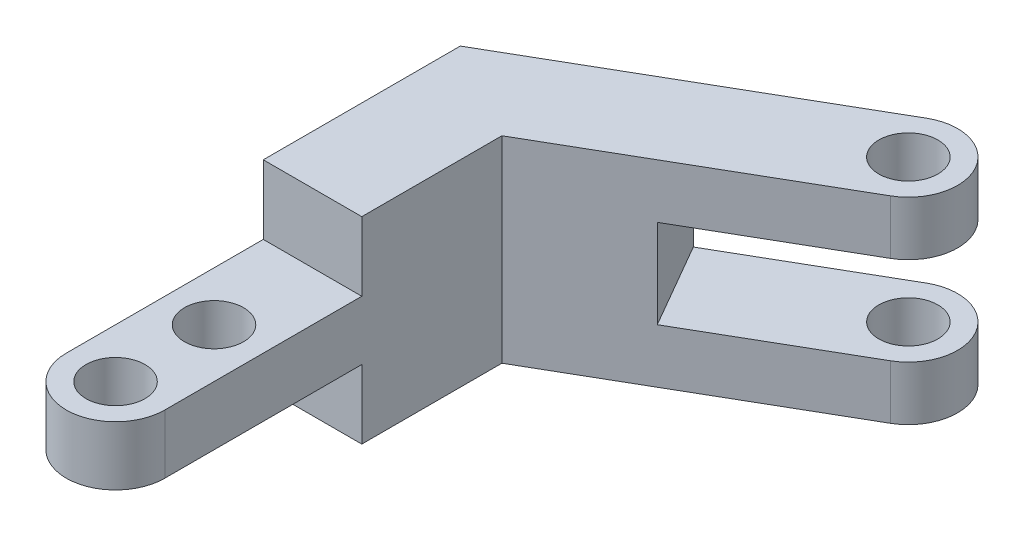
ISO-10303-21;
HEADER;
FILE_DESCRIPTION(('STEP AP214'),'2;1');
FILE_NAME('part.step','',(''),(''),'','','');
FILE_SCHEMA(('AUTOMOTIVE_DESIGN { 1 0 10303 214 1 1 1 1 }'));
ENDSEC;
DATA;
#1=APPLICATION_CONTEXT('core data for automotive mechanical design processes');
#2=APPLICATION_PROTOCOL_DEFINITION('international standard','automotive_design',2000,#1);
#3=PRODUCT_CONTEXT('',#1,'mechanical');
#4=PRODUCT('Part','Part','',(#3));
#5=PRODUCT_RELATED_PRODUCT_CATEGORY('part','',(#4));
#6=PRODUCT_DEFINITION_FORMATION('','',#4);
#7=PRODUCT_DEFINITION_CONTEXT('part definition',#1,'design');
#8=PRODUCT_DEFINITION('design','',#6,#7);
#9=PRODUCT_DEFINITION_SHAPE('','',#8);
#10=(LENGTH_UNIT() NAMED_UNIT(*) SI_UNIT(.MILLI.,.METRE.));
#11=(NAMED_UNIT(*) PLANE_ANGLE_UNIT() SI_UNIT($,.RADIAN.));
#12=(NAMED_UNIT(*) SI_UNIT($,.STERADIAN.) SOLID_ANGLE_UNIT());
#13=UNCERTAINTY_MEASURE_WITH_UNIT(LENGTH_MEASURE(1.E-05),#10,'distance_accuracy_value','');
#14=(GEOMETRIC_REPRESENTATION_CONTEXT(3) GLOBAL_UNCERTAINTY_ASSIGNED_CONTEXT((#13)) GLOBAL_UNIT_ASSIGNED_CONTEXT((#10,
#11,#12)) REPRESENTATION_CONTEXT('',''));
#15=CARTESIAN_POINT('',(0.,0.,0.));
#16=DIRECTION('',(0.,0.,1.));
#17=DIRECTION('',(1.,0.,0.));
#18=AXIS2_PLACEMENT_3D('',#15,#16,#17);
#19=CARTESIAN_POINT('',(2.5,10.,20.));
#20=DIRECTION('',(0.,-1.,0.));
#21=DIRECTION('',(0.,0.,-1.));
#22=AXIS2_PLACEMENT_3D('',#19,#20,#21);
#23=CYLINDRICAL_SURFACE('',#22,2.5);
#24=DIRECTION('',(0.,-1.,0.));
#25=VECTOR('',#24,1.);
#26=CARTESIAN_POINT('',(0.,10.,20.));
#27=LINE('',#26,#25);
#28=CARTESIAN_POINT('',(0.,6.5,20.));
#29=VERTEX_POINT('',#28);
#30=CARTESIAN_POINT('',(0.,3.5,20.));
#31=VERTEX_POINT('',#30);
#32=EDGE_CURVE('E55',#29,#31,#27,.T.);
#33=ORIENTED_EDGE('',*,*,#32,.T.);
#34=CARTESIAN_POINT('',(2.5,3.5,20.));
#35=DIRECTION('',(0.,1.,0.));
#36=DIRECTION('',(0.,0.,1.));
#37=AXIS2_PLACEMENT_3D('',#34,#35,#36);
#38=CIRCLE('',#37,2.5);
#39=CARTESIAN_POINT('',(5.,3.5,20.));
#40=VERTEX_POINT('',#39);
#41=EDGE_CURVE('E154',#31,#40,#38,.T.);
#42=ORIENTED_EDGE('',*,*,#41,.T.);
#43=DIRECTION('',(0.,-1.,0.));
#44=VECTOR('',#43,1.);
#45=CARTESIAN_POINT('',(5.,10.,20.));
#46=LINE('',#45,#44);
#47=CARTESIAN_POINT('',(5.,6.5,20.));
#48=VERTEX_POINT('',#47);
#49=EDGE_CURVE('E314',#48,#40,#46,.T.);
#50=ORIENTED_EDGE('',*,*,#49,.F.);
#51=CARTESIAN_POINT('',(2.5,6.5,20.));
#52=DIRECTION('',(0.,1.,0.));
#53=DIRECTION('',(0.,0.,1.));
#54=AXIS2_PLACEMENT_3D('',#51,#52,#53);
#55=CIRCLE('',#54,2.5);
#56=EDGE_CURVE('E212',#29,#48,#55,.T.);
#57=ORIENTED_EDGE('',*,*,#56,.F.);
#58=EDGE_LOOP('',(#33,#42,#50,#57));
#59=FACE_BOUND('',#58,.T.);
#60=ADVANCED_FACE('F45',(#59),#23,.T.);
#61=CARTESIAN_POINT('',(2.49999999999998,10.,15.));
#62=DIRECTION('',(0.,-1.,0.));
#63=DIRECTION('',(0.,0.,-1.));
#64=AXIS2_PLACEMENT_3D('',#61,#62,#63);
#65=CYLINDRICAL_SURFACE('',#64,1.5);
#66=CARTESIAN_POINT('',(2.49999999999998,3.5,15.));
#67=DIRECTION('',(0.,1.,0.));
#68=DIRECTION('',(0.,0.,1.));
#69=AXIS2_PLACEMENT_3D('',#66,#67,#68);
#70=CIRCLE('',#69,1.5);
#71=CARTESIAN_POINT('',(2.49999999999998,3.5,16.5));
#72=VERTEX_POINT('',#71);
#73=EDGE_CURVE('E183',#72,#72,#70,.T.);
#74=ORIENTED_EDGE('',*,*,#73,.F.);
#75=EDGE_LOOP('',(#74));
#76=FACE_BOUND('',#75,.T.);
#77=CARTESIAN_POINT('',(2.49999999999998,6.5,15.));
#78=DIRECTION('',(0.,1.,0.));
#79=DIRECTION('',(0.,0.,1.));
#80=AXIS2_PLACEMENT_3D('',#77,#78,#79);
#81=CIRCLE('',#80,1.5);
#82=CARTESIAN_POINT('',(2.49999999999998,6.5,16.5));
#83=VERTEX_POINT('',#82);
#84=EDGE_CURVE('E208',#83,#83,#81,.T.);
#85=ORIENTED_EDGE('',*,*,#84,.T.);
#86=EDGE_LOOP('',(#85));
#87=FACE_BOUND('',#86,.T.);
#88=ADVANCED_FACE('F47',(#76,#87),#65,.F.);
#89=CARTESIAN_POINT('',(2.5,10.,20.));
#90=DIRECTION('',(0.,-1.,0.));
#91=DIRECTION('',(0.,0.,-1.));
#92=AXIS2_PLACEMENT_3D('',#89,#90,#91);
#93=CYLINDRICAL_SURFACE('',#92,1.5);
#94=CARTESIAN_POINT('',(2.5,3.5,20.));
#95=DIRECTION('',(0.,1.,0.));
#96=DIRECTION('',(0.,0.,1.));
#97=AXIS2_PLACEMENT_3D('',#94,#95,#96);
#98=CIRCLE('',#97,1.5);
#99=CARTESIAN_POINT('',(2.5,3.5,21.5));
#100=VERTEX_POINT('',#99);
#101=EDGE_CURVE('E175',#100,#100,#98,.T.);
#102=ORIENTED_EDGE('',*,*,#101,.F.);
#103=EDGE_LOOP('',(#102));
#104=FACE_BOUND('',#103,.T.);
#105=CARTESIAN_POINT('',(2.5,6.5,20.));
#106=DIRECTION('',(0.,1.,0.));
#107=DIRECTION('',(0.,0.,1.));
#108=AXIS2_PLACEMENT_3D('',#105,#106,#107);
#109=CIRCLE('',#108,1.5);
#110=CARTESIAN_POINT('',(2.5,6.5,21.5));
#111=VERTEX_POINT('',#110);
#112=EDGE_CURVE('E49',#111,#111,#109,.T.);
#113=ORIENTED_EDGE('',*,*,#112,.T.);
#114=EDGE_LOOP('',(#113));
#115=FACE_BOUND('',#114,.T.);
#116=ADVANCED_FACE('F387',(#104,#115),#93,.F.);
#117=CARTESIAN_POINT('',(16.25,10.,-6.49519052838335));
#118=DIRECTION('',(0.,-1.,0.));
#119=DIRECTION('',(0.,0.,-1.));
#120=AXIS2_PLACEMENT_3D('',#117,#118,#119);
#121=CYLINDRICAL_SURFACE('',#120,2.50000000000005);
#122=DIRECTION('',(0.,-1.,0.));
#123=VECTOR('',#122,1.);
#124=CARTESIAN_POINT('',(15.,10.,-8.66025403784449));
#125=LINE('',#124,#123);
#126=CARTESIAN_POINT('',(15.,2.75,-8.66025403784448));
#127=VERTEX_POINT('',#126);
#128=CARTESIAN_POINT('',(15.,0.,-8.66025403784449));
#129=VERTEX_POINT('',#128);
#130=EDGE_CURVE('E301',#127,#129,#125,.T.);
#131=ORIENTED_EDGE('',*,*,#130,.F.);
#132=CARTESIAN_POINT('',(16.25,2.75,-6.49519052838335));
#133=DIRECTION('',(0.,-1.,0.));
#134=DIRECTION('',(0.,0.,-1.));
#135=AXIS2_PLACEMENT_3D('',#132,#133,#134);
#136=CIRCLE('',#135,2.50000000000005);
#137=CARTESIAN_POINT('',(17.5,2.75,-4.33012701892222));
#138=VERTEX_POINT('',#137);
#139=EDGE_CURVE('E250',#127,#138,#136,.T.);
#140=ORIENTED_EDGE('',*,*,#139,.T.);
#141=DIRECTION('',(0.,-1.,0.));
#142=VECTOR('',#141,1.);
#143=CARTESIAN_POINT('',(17.5,10.,-4.33012701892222));
#144=LINE('',#143,#142);
#145=CARTESIAN_POINT('',(17.5,0.,-4.33012701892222));
#146=VERTEX_POINT('',#145);
#147=EDGE_CURVE('E306',#138,#146,#144,.T.);
#148=ORIENTED_EDGE('',*,*,#147,.T.);
#149=CARTESIAN_POINT('',(16.25,0.,-6.49519052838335));
#150=DIRECTION('',(0.,1.,0.));
#151=DIRECTION('',(0.,0.,1.));
#152=AXIS2_PLACEMENT_3D('',#149,#150,#151);
#153=CIRCLE('',#152,2.50000000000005);
#154=EDGE_CURVE('E288',#146,#129,#153,.T.);
#155=ORIENTED_EDGE('',*,*,#154,.T.);
#156=EDGE_LOOP('',(#131,#140,#148,#155));
#157=FACE_BOUND('',#156,.T.);
#158=ADVANCED_FACE('F350',(#157),#121,.T.);
#159=CARTESIAN_POINT('',(16.25,10.,-6.49519052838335));
#160=DIRECTION('',(0.,-1.,0.));
#161=DIRECTION('',(0.,0.,-1.));
#162=AXIS2_PLACEMENT_3D('',#159,#160,#161);
#163=CYLINDRICAL_SURFACE('',#162,1.5);
#164=CARTESIAN_POINT('',(16.25,2.75,-6.49519052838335));
#165=DIRECTION('',(0.,-1.,0.));
#166=DIRECTION('',(0.,0.,-1.));
#167=AXIS2_PLACEMENT_3D('',#164,#165,#166);
#168=CIRCLE('',#167,1.5);
#169=CARTESIAN_POINT('',(16.25,2.75,-7.99519052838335));
#170=VERTEX_POINT('',#169);
#171=EDGE_CURVE('E246',#170,#170,#168,.T.);
#172=ORIENTED_EDGE('',*,*,#171,.F.);
#173=EDGE_LOOP('',(#172));
#174=FACE_BOUND('',#173,.T.);
#175=CARTESIAN_POINT('',(16.25,0.,-6.49519052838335));
#176=DIRECTION('',(0.,1.,0.));
#177=DIRECTION('',(0.,0.,1.));
#178=AXIS2_PLACEMENT_3D('',#175,#176,#177);
#179=CIRCLE('',#178,1.5);
#180=CARTESIAN_POINT('',(16.25,0.,-4.99519052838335));
#181=VERTEX_POINT('',#180);
#182=EDGE_CURVE('E259',#181,#181,#179,.T.);
#183=ORIENTED_EDGE('',*,*,#182,.F.);
#184=EDGE_LOOP('',(#183));
#185=FACE_BOUND('',#184,.T.);
#186=ADVANCED_FACE('F392',(#174,#185),#163,.F.);
#187=CARTESIAN_POINT('',(0.,10.,0.));
#188=DIRECTION('',(1.,0.,0.));
#189=DIRECTION('',(0.,0.,-1.));
#190=AXIS2_PLACEMENT_3D('',#187,#188,#189);
#191=PLANE('',#190);
#192=DIRECTION('',(0.,0.,1.));
#193=VECTOR('',#192,1.);
#194=CARTESIAN_POINT('',(0.,0.,0.));
#195=LINE('',#194,#193);
#196=CARTESIAN_POINT('',(0.,0.,0.));
#197=VERTEX_POINT('',#196);
#198=CARTESIAN_POINT('',(0.,0.,10.));
#199=VERTEX_POINT('',#198);
#200=EDGE_CURVE('E170',#197,#199,#195,.T.);
#201=ORIENTED_EDGE('',*,*,#200,.T.);
#202=DIRECTION('',(0.,-1.,0.));
#203=VECTOR('',#202,1.);
#204=CARTESIAN_POINT('',(0.,3.5,10.));
#205=LINE('',#204,#203);
#206=CARTESIAN_POINT('',(0.,3.5,10.));
#207=VERTEX_POINT('',#206);
#208=EDGE_CURVE('E62',#207,#199,#205,.T.);
#209=ORIENTED_EDGE('',*,*,#208,.F.);
#210=DIRECTION('',(0.,0.,-1.));
#211=VECTOR('',#210,1.);
#212=CARTESIAN_POINT('',(0.,3.5,10.));
#213=LINE('',#212,#211);
#214=EDGE_CURVE('E149',#31,#207,#213,.T.);
#215=ORIENTED_EDGE('',*,*,#214,.F.);
#216=ORIENTED_EDGE('',*,*,#32,.F.);
#217=DIRECTION('',(0.,0.,1.));
#218=VECTOR('',#217,1.);
#219=CARTESIAN_POINT('',(0.,6.5,10.));
#220=LINE('',#219,#218);
#221=CARTESIAN_POINT('',(0.,6.5,10.));
#222=VERTEX_POINT('',#221);
#223=EDGE_CURVE('E190',#222,#29,#220,.T.);
#224=ORIENTED_EDGE('',*,*,#223,.F.);
#225=DIRECTION('',(0.,1.,0.));
#226=VECTOR('',#225,1.);
#227=CARTESIAN_POINT('',(0.,6.5,10.));
#228=LINE('',#227,#226);
#229=CARTESIAN_POINT('',(0.,10.,10.));
#230=VERTEX_POINT('',#229);
#231=EDGE_CURVE('E202',#222,#230,#228,.T.);
#232=ORIENTED_EDGE('',*,*,#231,.T.);
#233=DIRECTION('',(0.,0.,1.));
#234=VECTOR('',#233,1.);
#235=CARTESIAN_POINT('',(0.,10.,0.));
#236=LINE('',#235,#234);
#237=CARTESIAN_POINT('',(0.,10.,0.));
#238=VERTEX_POINT('',#237);
#239=EDGE_CURVE('E254',#238,#230,#236,.T.);
#240=ORIENTED_EDGE('',*,*,#239,.F.);
#241=DIRECTION('',(0.,-1.,0.));
#242=VECTOR('',#241,1.);
#243=CARTESIAN_POINT('',(0.,10.,0.));
#244=LINE('',#243,#242);
#245=EDGE_CURVE('E277',#238,#197,#244,.T.);
#246=ORIENTED_EDGE('',*,*,#245,.T.);
#247=EDGE_LOOP('',(#201,#209,#215,#216,#224,#232,#240,#246));
#248=FACE_BOUND('',#247,.T.);
#249=ADVANCED_FACE('F168',(#248),#191,.F.);
#250=CARTESIAN_POINT('',(5.,10.,0.));
#251=DIRECTION('',(1.,0.,0.));
#252=DIRECTION('',(0.,0.,-1.));
#253=AXIS2_PLACEMENT_3D('',#250,#251,#252);
#254=PLANE('',#253);
#255=DIRECTION('',(0.,-1.,0.));
#256=VECTOR('',#255,1.);
#257=CARTESIAN_POINT('',(5.,3.5,10.));
#258=LINE('',#257,#256);
#259=CARTESIAN_POINT('',(5.,3.5,10.));
#260=VERTEX_POINT('',#259);
#261=CARTESIAN_POINT('',(5.,0.,10.));
#262=VERTEX_POINT('',#261);
#263=EDGE_CURVE('E163',#260,#262,#258,.T.);
#264=ORIENTED_EDGE('',*,*,#263,.T.);
#265=DIRECTION('',(0.,0.,1.));
#266=VECTOR('',#265,1.);
#267=CARTESIAN_POINT('',(5.,0.,0.));
#268=LINE('',#267,#266);
#269=CARTESIAN_POINT('',(5.,0.,2.88675134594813));
#270=VERTEX_POINT('',#269);
#271=EDGE_CURVE('E280',#270,#262,#268,.T.);
#272=ORIENTED_EDGE('',*,*,#271,.F.);
#273=DIRECTION('',(0.,-1.,0.));
#274=VECTOR('',#273,1.);
#275=CARTESIAN_POINT('',(5.,10.,2.88675134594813));
#276=LINE('',#275,#274);
#277=CARTESIAN_POINT('',(5.,10.,2.88675134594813));
#278=VERTEX_POINT('',#277);
#279=EDGE_CURVE('E311',#278,#270,#276,.T.);
#280=ORIENTED_EDGE('',*,*,#279,.F.);
#281=DIRECTION('',(0.,0.,1.));
#282=VECTOR('',#281,1.);
#283=CARTESIAN_POINT('',(5.,10.,0.));
#284=LINE('',#283,#282);
#285=CARTESIAN_POINT('',(5.,10.,10.));
#286=VERTEX_POINT('',#285);
#287=EDGE_CURVE('E258',#278,#286,#284,.T.);
#288=ORIENTED_EDGE('',*,*,#287,.T.);
#289=DIRECTION('',(0.,1.,0.));
#290=VECTOR('',#289,1.);
#291=CARTESIAN_POINT('',(5.,6.5,10.));
#292=LINE('',#291,#290);
#293=CARTESIAN_POINT('',(5.,6.5,10.));
#294=VERTEX_POINT('',#293);
#295=EDGE_CURVE('E70',#294,#286,#292,.T.);
#296=ORIENTED_EDGE('',*,*,#295,.F.);
#297=DIRECTION('',(0.,0.,-1.));
#298=VECTOR('',#297,1.);
#299=CARTESIAN_POINT('',(5.,6.5,10.));
#300=LINE('',#299,#298);
#301=EDGE_CURVE('E193',#48,#294,#300,.T.);
#302=ORIENTED_EDGE('',*,*,#301,.F.);
#303=ORIENTED_EDGE('',*,*,#49,.T.);
#304=DIRECTION('',(0.,0.,1.));
#305=VECTOR('',#304,1.);
#306=CARTESIAN_POINT('',(5.,3.5,10.));
#307=LINE('',#306,#305);
#308=EDGE_CURVE('E165',#260,#40,#307,.T.);
#309=ORIENTED_EDGE('',*,*,#308,.F.);
#310=EDGE_LOOP('',(#264,#272,#280,#288,#296,#302,#303,#309));
#311=FACE_BOUND('',#310,.T.);
#312=ADVANCED_FACE('F329',(#311),#254,.T.);
#313=CARTESIAN_POINT('',(2.5,10.,4.33012701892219));
#314=DIRECTION('',(-0.5,0.,-0.866025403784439));
#315=DIRECTION('',(-0.866025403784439,0.,0.5));
#316=AXIS2_PLACEMENT_3D('',#313,#314,#315);
#317=PLANE('',#316);
#318=ORIENTED_EDGE('',*,*,#147,.F.);
#319=DIRECTION('',(0.866025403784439,0.,-0.5));
#320=VECTOR('',#319,1.);
#321=CARTESIAN_POINT('',(25.0000000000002,2.75,-8.66025403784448));
#322=LINE('',#321,#320);
#323=CARTESIAN_POINT('',(10.,2.75,0.));
#324=VERTEX_POINT('',#323);
#325=EDGE_CURVE('E216',#324,#138,#322,.T.);
#326=ORIENTED_EDGE('',*,*,#325,.F.);
#327=DIRECTION('',(0.,-1.,0.));
#328=VECTOR('',#327,1.);
#329=CARTESIAN_POINT('',(10.,2.75,0.));
#330=LINE('',#329,#328);
#331=CARTESIAN_POINT('',(10.,7.25,0.));
#332=VERTEX_POINT('',#331);
#333=EDGE_CURVE('E219',#332,#324,#330,.T.);
#334=ORIENTED_EDGE('',*,*,#333,.F.);
#335=DIRECTION('',(-0.866025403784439,0.,0.5));
#336=VECTOR('',#335,1.);
#337=CARTESIAN_POINT('',(25.0000000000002,7.25,-8.66025403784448));
#338=LINE('',#337,#336);
#339=CARTESIAN_POINT('',(17.5,7.25,-4.33012701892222));
#340=VERTEX_POINT('',#339);
#341=EDGE_CURVE('E223',#340,#332,#338,.T.);
#342=ORIENTED_EDGE('',*,*,#341,.F.);
#343=CARTESIAN_POINT('',(17.5,10.,-4.33012701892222));
#344=VERTEX_POINT('',#343);
#345=EDGE_CURVE('E307',#344,#340,#144,.T.);
#346=ORIENTED_EDGE('',*,*,#345,.F.);
#347=DIRECTION('',(0.866025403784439,0.,-0.5));
#348=VECTOR('',#347,1.);
#349=CARTESIAN_POINT('',(2.5,10.,4.33012701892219));
#350=LINE('',#349,#348);
#351=EDGE_CURVE('E263',#278,#344,#350,.T.);
#352=ORIENTED_EDGE('',*,*,#351,.F.);
#353=ORIENTED_EDGE('',*,*,#279,.T.);
#354=DIRECTION('',(0.866025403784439,0.,-0.5));
#355=VECTOR('',#354,1.);
#356=CARTESIAN_POINT('',(2.5,0.,4.33012701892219));
#357=LINE('',#356,#355);
#358=EDGE_CURVE('E284',#270,#146,#357,.T.);
#359=ORIENTED_EDGE('',*,*,#358,.T.);
#360=EDGE_LOOP('',(#318,#326,#334,#342,#346,#352,#353,#359));
#361=FACE_BOUND('',#360,.T.);
#362=ADVANCED_FACE('F354',(#361),#317,.F.);
#363=ORIENTED_EDGE('',*,*,#345,.T.);
#364=CARTESIAN_POINT('',(16.25,7.25,-6.49519052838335));
#365=DIRECTION('',(0.,1.,0.));
#366=DIRECTION('',(0.,0.,1.));
#367=AXIS2_PLACEMENT_3D('',#364,#365,#366);
#368=CIRCLE('',#367,2.50000000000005);
#369=CARTESIAN_POINT('',(15.,7.25,-8.66025403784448));
#370=VERTEX_POINT('',#369);
#371=EDGE_CURVE('E242',#340,#370,#368,.T.);
#372=ORIENTED_EDGE('',*,*,#371,.T.);
#373=CARTESIAN_POINT('',(15.,10.,-8.66025403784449));
#374=VERTEX_POINT('',#373);
#375=EDGE_CURVE('E302',#374,#370,#125,.T.);
#376=ORIENTED_EDGE('',*,*,#375,.F.);
#377=CARTESIAN_POINT('',(16.25,10.,-6.49519052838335));
#378=DIRECTION('',(0.,1.,0.));
#379=DIRECTION('',(0.,0.,1.));
#380=AXIS2_PLACEMENT_3D('',#377,#378,#379);
#381=CIRCLE('',#380,2.50000000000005);
#382=EDGE_CURVE('E266',#344,#374,#381,.T.);
#383=ORIENTED_EDGE('',*,*,#382,.F.);
#384=EDGE_LOOP('',(#363,#372,#376,#383));
#385=FACE_BOUND('',#384,.T.);
#386=ADVANCED_FACE('F361',(#385),#121,.T.);
#387=CARTESIAN_POINT('',(16.25,7.25,-6.49519052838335));
#388=DIRECTION('',(0.,1.,0.));
#389=DIRECTION('',(0.,0.,1.));
#390=AXIS2_PLACEMENT_3D('',#387,#388,#389);
#391=CIRCLE('',#390,1.5);
#392=CARTESIAN_POINT('',(16.25,7.25,-4.99519052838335));
#393=VERTEX_POINT('',#392);
#394=EDGE_CURVE('E238',#393,#393,#391,.T.);
#395=ORIENTED_EDGE('',*,*,#394,.F.);
#396=EDGE_LOOP('',(#395));
#397=FACE_BOUND('',#396,.T.);
#398=CARTESIAN_POINT('',(16.25,10.,-6.49519052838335));
#399=DIRECTION('',(0.,1.,0.));
#400=DIRECTION('',(0.,0.,1.));
#401=AXIS2_PLACEMENT_3D('',#398,#399,#400);
#402=CIRCLE('',#401,1.5);
#403=CARTESIAN_POINT('',(16.25,10.,-4.99519052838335));
#404=VERTEX_POINT('',#403);
#405=EDGE_CURVE('E273',#404,#404,#402,.T.);
#406=ORIENTED_EDGE('',*,*,#405,.T.);
#407=EDGE_LOOP('',(#406));
#408=FACE_BOUND('',#407,.T.);
#409=ADVANCED_FACE('F399',(#397,#408),#163,.F.);
#410=CARTESIAN_POINT('',(0.,10.,0.));
#411=DIRECTION('',(-0.500000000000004,0.,-0.866025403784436));
#412=DIRECTION('',(-0.866025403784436,0.,0.500000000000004));
#413=AXIS2_PLACEMENT_3D('',#410,#411,#412);
#414=PLANE('',#413);
#415=DIRECTION('',(-0.866025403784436,0.,0.500000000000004));
#416=VECTOR('',#415,1.);
#417=CARTESIAN_POINT('',(0.,2.75,0.));
#418=LINE('',#417,#416);
#419=CARTESIAN_POINT('',(7.5,2.75,-4.33012701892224));
#420=VERTEX_POINT('',#419);
#421=EDGE_CURVE('E11',#127,#420,#418,.T.);
#422=ORIENTED_EDGE('',*,*,#421,.F.);
#423=ORIENTED_EDGE('',*,*,#130,.T.);
#424=DIRECTION('',(0.866025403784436,0.,-0.500000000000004));
#425=VECTOR('',#424,1.);
#426=CARTESIAN_POINT('',(0.,0.,0.));
#427=LINE('',#426,#425);
#428=EDGE_CURVE('E292',#197,#129,#427,.T.);
#429=ORIENTED_EDGE('',*,*,#428,.F.);
#430=ORIENTED_EDGE('',*,*,#245,.F.);
#431=DIRECTION('',(0.866025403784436,0.,-0.500000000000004));
#432=VECTOR('',#431,1.);
#433=CARTESIAN_POINT('',(0.,10.,0.));
#434=LINE('',#433,#432);
#435=EDGE_CURVE('E269',#238,#374,#434,.T.);
#436=ORIENTED_EDGE('',*,*,#435,.T.);
#437=ORIENTED_EDGE('',*,*,#375,.T.);
#438=DIRECTION('',(0.866025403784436,0.,-0.500000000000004));
#439=VECTOR('',#438,1.);
#440=CARTESIAN_POINT('',(22.5,7.25,-12.9903810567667));
#441=LINE('',#440,#439);
#442=CARTESIAN_POINT('',(7.5,7.25,-4.33012701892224));
#443=VERTEX_POINT('',#442);
#444=EDGE_CURVE('E226',#443,#370,#441,.T.);
#445=ORIENTED_EDGE('',*,*,#444,.F.);
#446=DIRECTION('',(0.,1.,0.));
#447=VECTOR('',#446,1.);
#448=CARTESIAN_POINT('',(7.5,2.75,-4.33012701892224));
#449=LINE('',#448,#447);
#450=EDGE_CURVE('E215',#420,#443,#449,.T.);
#451=ORIENTED_EDGE('',*,*,#450,.F.);
#452=EDGE_LOOP('',(#422,#423,#429,#430,#436,#437,#445,#451));
#453=FACE_BOUND('',#452,.T.);
#454=ADVANCED_FACE('F345',(#453),#414,.T.);
#455=CARTESIAN_POINT('',(0.,10.,0.));
#456=DIRECTION('',(0.,1.,0.));
#457=DIRECTION('',(0.,0.,1.));
#458=AXIS2_PLACEMENT_3D('',#455,#456,#457);
#459=PLANE('',#458);
#460=DIRECTION('',(-1.,0.,0.));
#461=VECTOR('',#460,1.);
#462=CARTESIAN_POINT('',(0.,10.,10.));
#463=LINE('',#462,#461);
#464=EDGE_CURVE('E189',#286,#230,#463,.T.);
#465=ORIENTED_EDGE('',*,*,#464,.F.);
#466=ORIENTED_EDGE('',*,*,#287,.F.);
#467=ORIENTED_EDGE('',*,*,#351,.T.);
#468=ORIENTED_EDGE('',*,*,#382,.T.);
#469=ORIENTED_EDGE('',*,*,#435,.F.);
#470=ORIENTED_EDGE('',*,*,#239,.T.);
#471=EDGE_LOOP('',(#465,#466,#467,#468,#469,#470));
#472=FACE_BOUND('',#471,.T.);
#473=ORIENTED_EDGE('',*,*,#405,.F.);
#474=EDGE_LOOP('',(#473));
#475=FACE_BOUND('',#474,.T.);
#476=ADVANCED_FACE('F334',(#472,#475),#459,.T.);
#477=CARTESIAN_POINT('',(0.,0.,0.));
#478=DIRECTION('',(0.,1.,0.));
#479=DIRECTION('',(0.,0.,1.));
#480=AXIS2_PLACEMENT_3D('',#477,#478,#479);
#481=PLANE('',#480);
#482=ORIENTED_EDGE('',*,*,#271,.T.);
#483=DIRECTION('',(1.,0.,0.));
#484=VECTOR('',#483,1.);
#485=CARTESIAN_POINT('',(0.,0.,10.));
#486=LINE('',#485,#484);
#487=EDGE_CURVE('E159',#199,#262,#486,.T.);
#488=ORIENTED_EDGE('',*,*,#487,.F.);
#489=ORIENTED_EDGE('',*,*,#200,.F.);
#490=ORIENTED_EDGE('',*,*,#428,.T.);
#491=ORIENTED_EDGE('',*,*,#154,.F.);
#492=ORIENTED_EDGE('',*,*,#358,.F.);
#493=EDGE_LOOP('',(#482,#488,#489,#490,#491,#492));
#494=FACE_BOUND('',#493,.T.);
#495=ORIENTED_EDGE('',*,*,#182,.T.);
#496=EDGE_LOOP('',(#495));
#497=FACE_BOUND('',#496,.T.);
#498=ADVANCED_FACE('F341',(#494,#497),#481,.F.);
#499=CARTESIAN_POINT('',(33.9477650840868,2.75,6.83772970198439));
#500=DIRECTION('',(0.,-1.,0.));
#501=DIRECTION('',(0.,0.,-1.));
#502=AXIS2_PLACEMENT_3D('',#499,#500,#501);
#503=PLANE('',#502);
#504=ORIENTED_EDGE('',*,*,#171,.T.);
#505=EDGE_LOOP('',(#504));
#506=FACE_BOUND('',#505,.T.);
#507=ORIENTED_EDGE('',*,*,#421,.T.);
#508=DIRECTION('',(-0.500000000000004,0.,-0.866025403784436));
#509=VECTOR('',#508,1.);
#510=CARTESIAN_POINT('',(18.9477650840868,2.75,15.4979837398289));
#511=LINE('',#510,#509);
#512=EDGE_CURVE('E220',#324,#420,#511,.T.);
#513=ORIENTED_EDGE('',*,*,#512,.F.);
#514=ORIENTED_EDGE('',*,*,#325,.T.);
#515=ORIENTED_EDGE('',*,*,#139,.F.);
#516=EDGE_LOOP('',(#507,#513,#514,#515));
#517=FACE_BOUND('',#516,.T.);
#518=ADVANCED_FACE('F370',(#506,#517),#503,.F.);
#519=CARTESIAN_POINT('',(33.9477650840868,7.25,6.83772970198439));
#520=DIRECTION('',(0.,1.,0.));
#521=DIRECTION('',(0.,0.,1.));
#522=AXIS2_PLACEMENT_3D('',#519,#520,#521);
#523=PLANE('',#522);
#524=ORIENTED_EDGE('',*,*,#394,.T.);
#525=EDGE_LOOP('',(#524));
#526=FACE_BOUND('',#525,.T.);
#527=ORIENTED_EDGE('',*,*,#341,.T.);
#528=DIRECTION('',(-0.500000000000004,0.,-0.866025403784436));
#529=VECTOR('',#528,1.);
#530=CARTESIAN_POINT('',(18.9477650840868,7.25,15.4979837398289));
#531=LINE('',#530,#529);
#532=EDGE_CURVE('E229',#332,#443,#531,.T.);
#533=ORIENTED_EDGE('',*,*,#532,.T.);
#534=ORIENTED_EDGE('',*,*,#444,.T.);
#535=ORIENTED_EDGE('',*,*,#371,.F.);
#536=EDGE_LOOP('',(#527,#533,#534,#535));
#537=FACE_BOUND('',#536,.T.);
#538=ADVANCED_FACE('F364',(#526,#537),#523,.F.);
#539=CARTESIAN_POINT('',(18.9477650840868,2.75,15.4979837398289));
#540=DIRECTION('',(-0.866025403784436,0.,0.500000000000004));
#541=DIRECTION('',(0.500000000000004,0.,0.866025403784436));
#542=AXIS2_PLACEMENT_3D('',#539,#540,#541);
#543=PLANE('',#542);
#544=ORIENTED_EDGE('',*,*,#333,.T.);
#545=ORIENTED_EDGE('',*,*,#512,.T.);
#546=ORIENTED_EDGE('',*,*,#450,.T.);
#547=ORIENTED_EDGE('',*,*,#532,.F.);
#548=EDGE_LOOP('',(#544,#545,#546,#547));
#549=FACE_BOUND('',#548,.T.);
#550=ADVANCED_FACE('F367',(#549),#543,.F.);
#551=CARTESIAN_POINT('',(0.,6.5,0.));
#552=DIRECTION('',(0.,1.,0.));
#553=DIRECTION('',(0.,0.,1.));
#554=AXIS2_PLACEMENT_3D('',#551,#552,#553);
#555=PLANE('',#554);
#556=ORIENTED_EDGE('',*,*,#112,.F.);
#557=EDGE_LOOP('',(#556));
#558=FACE_BOUND('',#557,.T.);
#559=ORIENTED_EDGE('',*,*,#84,.F.);
#560=EDGE_LOOP('',(#559));
#561=FACE_BOUND('',#560,.T.);
#562=ORIENTED_EDGE('',*,*,#56,.T.);
#563=ORIENTED_EDGE('',*,*,#301,.T.);
#564=DIRECTION('',(-1.,0.,0.));
#565=VECTOR('',#564,1.);
#566=CARTESIAN_POINT('',(0.,6.5,10.));
#567=LINE('',#566,#565);
#568=EDGE_CURVE('E196',#294,#222,#567,.T.);
#569=ORIENTED_EDGE('',*,*,#568,.T.);
#570=ORIENTED_EDGE('',*,*,#223,.T.);
#571=EDGE_LOOP('',(#562,#563,#569,#570));
#572=FACE_BOUND('',#571,.T.);
#573=ADVANCED_FACE('F325',(#558,#561,#572),#555,.T.);
#574=CARTESIAN_POINT('',(0.,6.5,10.));
#575=DIRECTION('',(0.,0.,-1.));
#576=DIRECTION('',(-1.,0.,0.));
#577=AXIS2_PLACEMENT_3D('',#574,#575,#576);
#578=PLANE('',#577);
#579=ORIENTED_EDGE('',*,*,#464,.T.);
#580=ORIENTED_EDGE('',*,*,#231,.F.);
#581=ORIENTED_EDGE('',*,*,#568,.F.);
#582=ORIENTED_EDGE('',*,*,#295,.T.);
#583=EDGE_LOOP('',(#579,#580,#581,#582));
#584=FACE_BOUND('',#583,.T.);
#585=ADVANCED_FACE('F327',(#584),#578,.F.);
#586=CARTESIAN_POINT('',(0.,3.5,0.));
#587=DIRECTION('',(0.,1.,0.));
#588=DIRECTION('',(0.,0.,1.));
#589=AXIS2_PLACEMENT_3D('',#586,#587,#588);
#590=PLANE('',#589);
#591=ORIENTED_EDGE('',*,*,#73,.T.);
#592=EDGE_LOOP('',(#591));
#593=FACE_BOUND('',#592,.T.);
#594=ORIENTED_EDGE('',*,*,#101,.T.);
#595=EDGE_LOOP('',(#594));
#596=FACE_BOUND('',#595,.T.);
#597=ORIENTED_EDGE('',*,*,#214,.T.);
#598=DIRECTION('',(1.,0.,0.));
#599=VECTOR('',#598,1.);
#600=CARTESIAN_POINT('',(0.,3.5,10.));
#601=LINE('',#600,#599);
#602=EDGE_CURVE('E151',#207,#260,#601,.T.);
#603=ORIENTED_EDGE('',*,*,#602,.T.);
#604=ORIENTED_EDGE('',*,*,#308,.T.);
#605=ORIENTED_EDGE('',*,*,#41,.F.);
#606=EDGE_LOOP('',(#597,#603,#604,#605));
#607=FACE_BOUND('',#606,.T.);
#608=ADVANCED_FACE('F150',(#593,#596,#607),#590,.F.);
#609=CARTESIAN_POINT('',(0.,3.5,10.));
#610=DIRECTION('',(0.,0.,-1.));
#611=DIRECTION('',(-1.,0.,0.));
#612=AXIS2_PLACEMENT_3D('',#609,#610,#611);
#613=PLANE('',#612);
#614=ORIENTED_EDGE('',*,*,#487,.T.);
#615=ORIENTED_EDGE('',*,*,#263,.F.);
#616=ORIENTED_EDGE('',*,*,#602,.F.);
#617=ORIENTED_EDGE('',*,*,#208,.T.);
#618=EDGE_LOOP('',(#614,#615,#616,#617));
#619=FACE_BOUND('',#618,.T.);
#620=ADVANCED_FACE('F161',(#619),#613,.F.);
#621=CLOSED_SHELL('',(#60,#88,#116,#158,#186,#249,#312,#362,#386,#409,#454,#476,#498,#518,#538,
#550,#573,#585,#608,#620));
#622=MANIFOLD_SOLID_BREP('B2',#621);
#623=ADVANCED_BREP_SHAPE_REPRESENTATION('',(#18,#622),#14);
#624=SHAPE_DEFINITION_REPRESENTATION(#9,#623);
ENDSEC;
END-ISO-10303-21;
